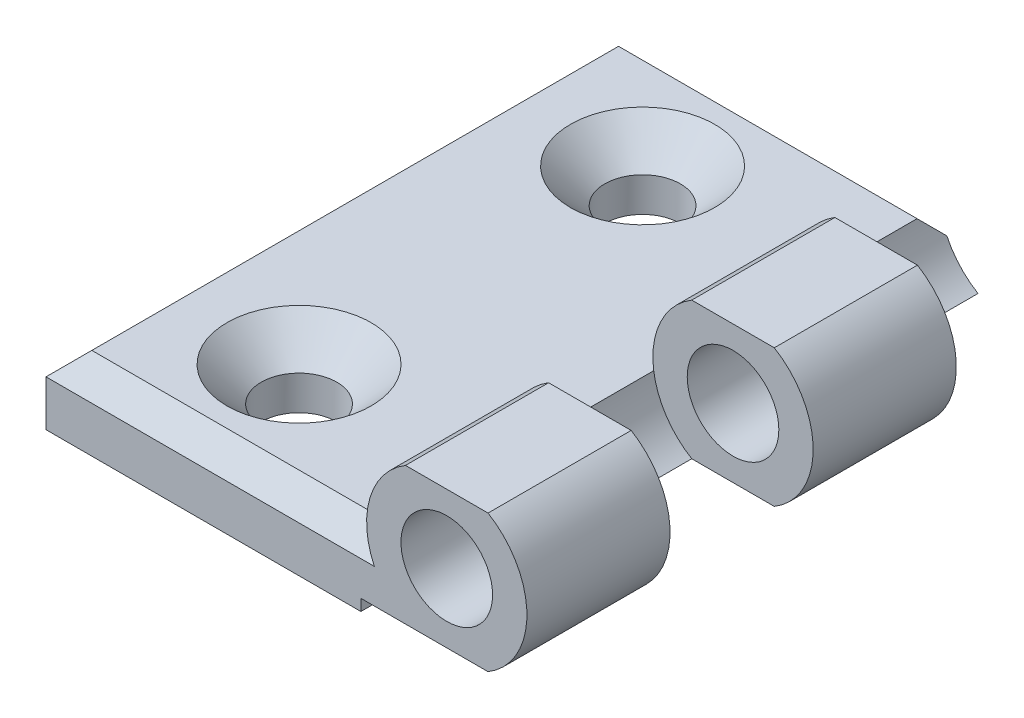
ISO-10303-21;
HEADER;
FILE_DESCRIPTION(('STEP AP214'),'2;1');
FILE_NAME('part.step','',(''),(''),'','','');
FILE_SCHEMA(('AUTOMOTIVE_DESIGN { 1 0 10303 214 1 1 1 1 }'));
ENDSEC;
DATA;
#1=APPLICATION_CONTEXT('core data for automotive mechanical design processes');
#2=APPLICATION_PROTOCOL_DEFINITION('international standard','automotive_design',2000,#1);
#3=PRODUCT_CONTEXT('',#1,'mechanical');
#4=PRODUCT('Part','Part','',(#3));
#5=PRODUCT_RELATED_PRODUCT_CATEGORY('part','',(#4));
#6=PRODUCT_DEFINITION_FORMATION('','',#4);
#7=PRODUCT_DEFINITION_CONTEXT('part definition',#1,'design');
#8=PRODUCT_DEFINITION('design','',#6,#7);
#9=PRODUCT_DEFINITION_SHAPE('','',#8);
#10=(LENGTH_UNIT() NAMED_UNIT(*) SI_UNIT(.MILLI.,.METRE.));
#11=(NAMED_UNIT(*) PLANE_ANGLE_UNIT() SI_UNIT($,.RADIAN.));
#12=(NAMED_UNIT(*) SI_UNIT($,.STERADIAN.) SOLID_ANGLE_UNIT());
#13=UNCERTAINTY_MEASURE_WITH_UNIT(LENGTH_MEASURE(1.E-05),#10,'distance_accuracy_value','');
#14=(GEOMETRIC_REPRESENTATION_CONTEXT(3) GLOBAL_UNCERTAINTY_ASSIGNED_CONTEXT((#13)) GLOBAL_UNIT_ASSIGNED_CONTEXT((#10,
#11,#12)) REPRESENTATION_CONTEXT('',''));
#15=CARTESIAN_POINT('',(0.,0.,0.));
#16=DIRECTION('',(0.,0.,1.));
#17=DIRECTION('',(1.,0.,0.));
#18=AXIS2_PLACEMENT_3D('',#15,#16,#17);
#19=CARTESIAN_POINT('',(0.,0.,25.));
#20=DIRECTION('',(0.,0.,-1.));
#21=DIRECTION('',(-1.,0.,0.));
#22=AXIS2_PLACEMENT_3D('',#19,#20,#21);
#23=CYLINDRICAL_SURFACE('',#22,7.);
#24=CARTESIAN_POINT('',(0.,0.,-12.5));
#25=DIRECTION('',(0.,0.,-1.));
#26=DIRECTION('',(-1.,0.,0.));
#27=AXIS2_PLACEMENT_3D('',#24,#25,#26);
#28=CIRCLE('',#27,7.);
#29=CARTESIAN_POINT('',(3.60555127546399,6.,-12.5));
#30=VERTEX_POINT('',#29);
#31=CARTESIAN_POINT('',(3.60555127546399,-6.,-12.5));
#32=VERTEX_POINT('',#31);
#33=EDGE_CURVE('E316',#30,#32,#28,.T.);
#34=ORIENTED_EDGE('',*,*,#33,.F.);
#35=DIRECTION('',(0.,0.,-1.));
#36=VECTOR('',#35,1.);
#37=CARTESIAN_POINT('',(3.60555127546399,6.,25.));
#38=LINE('',#37,#36);
#39=CARTESIAN_POINT('',(3.60555127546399,6.,0.));
#40=VERTEX_POINT('',#39);
#41=EDGE_CURVE('E221',#40,#30,#38,.T.);
#42=ORIENTED_EDGE('',*,*,#41,.F.);
#43=CARTESIAN_POINT('',(0.,0.,0.));
#44=DIRECTION('',(0.,0.,1.));
#45=DIRECTION('',(1.,0.,0.));
#46=AXIS2_PLACEMENT_3D('',#43,#44,#45);
#47=CIRCLE('',#46,7.);
#48=CARTESIAN_POINT('',(3.60555127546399,-6.,0.));
#49=VERTEX_POINT('',#48);
#50=EDGE_CURVE('E279',#49,#40,#47,.T.);
#51=ORIENTED_EDGE('',*,*,#50,.F.);
#52=DIRECTION('',(0.,0.,-1.));
#53=VECTOR('',#52,1.);
#54=CARTESIAN_POINT('',(3.60555127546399,-6.,25.));
#55=LINE('',#54,#53);
#56=EDGE_CURVE('E226',#49,#32,#55,.T.);
#57=ORIENTED_EDGE('',*,*,#56,.T.);
#58=EDGE_LOOP('',(#34,#42,#51,#57));
#59=FACE_BOUND('',#58,.T.);
#60=ADVANCED_FACE('F43',(#59),#23,.T.);
#61=CARTESIAN_POINT('',(3.60555127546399,6.,25.));
#62=DIRECTION('',(0.,-1.,0.));
#63=DIRECTION('',(0.,0.,-1.));
#64=AXIS2_PLACEMENT_3D('',#61,#62,#63);
#65=PLANE('',#64);
#66=DIRECTION('',(1.,0.,0.));
#67=VECTOR('',#66,1.);
#68=CARTESIAN_POINT('',(3.60555127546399,6.,-12.5));
#69=LINE('',#68,#67);
#70=CARTESIAN_POINT('',(-3.60555127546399,6.,-12.5));
#71=VERTEX_POINT('',#70);
#72=EDGE_CURVE('E305',#71,#30,#69,.T.);
#73=ORIENTED_EDGE('',*,*,#72,.F.);
#74=DIRECTION('',(0.,0.,-1.));
#75=VECTOR('',#74,1.);
#76=CARTESIAN_POINT('',(-3.60555127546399,6.,25.));
#77=LINE('',#76,#75);
#78=CARTESIAN_POINT('',(-3.60555127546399,6.,0.));
#79=VERTEX_POINT('',#78);
#80=EDGE_CURVE('E215',#79,#71,#77,.T.);
#81=ORIENTED_EDGE('',*,*,#80,.F.);
#82=DIRECTION('',(-1.,0.,0.));
#83=VECTOR('',#82,1.);
#84=CARTESIAN_POINT('',(3.60555127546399,6.,0.));
#85=LINE('',#84,#83);
#86=EDGE_CURVE('E425',#40,#79,#85,.T.);
#87=ORIENTED_EDGE('',*,*,#86,.F.);
#88=ORIENTED_EDGE('',*,*,#41,.T.);
#89=EDGE_LOOP('',(#73,#81,#87,#88));
#90=FACE_BOUND('',#89,.T.);
#91=ADVANCED_FACE('F478',(#90),#65,.F.);
#92=CARTESIAN_POINT('',(0.,0.,25.));
#93=DIRECTION('',(0.,0.,-1.));
#94=DIRECTION('',(-1.,0.,0.));
#95=AXIS2_PLACEMENT_3D('',#92,#93,#94);
#96=CYLINDRICAL_SURFACE('',#95,7.);
#97=CARTESIAN_POINT('',(-6.92820323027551,-1.,-12.5));
#98=VERTEX_POINT('',#97);
#99=EDGE_CURVE('E185',#98,#71,#28,.T.);
#100=ORIENTED_EDGE('',*,*,#99,.F.);
#101=DIRECTION('',(0.,0.,-1.));
#102=VECTOR('',#101,1.);
#103=CARTESIAN_POINT('',(-6.92820323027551,-1.,25.));
#104=LINE('',#103,#102);
#105=CARTESIAN_POINT('',(-6.92820323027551,-1.,0.));
#106=VERTEX_POINT('',#105);
#107=EDGE_CURVE('E209',#106,#98,#104,.T.);
#108=ORIENTED_EDGE('',*,*,#107,.F.);
#109=EDGE_CURVE('E61',#79,#106,#47,.T.);
#110=ORIENTED_EDGE('',*,*,#109,.F.);
#111=ORIENTED_EDGE('',*,*,#80,.T.);
#112=EDGE_LOOP('',(#100,#108,#110,#111));
#113=FACE_BOUND('',#112,.T.);
#114=ADVANCED_FACE('F485',(#113),#96,.T.);
#115=CARTESIAN_POINT('',(0.,0.,25.));
#116=DIRECTION('',(0.,0.,-1.));
#117=DIRECTION('',(-1.,0.,0.));
#118=AXIS2_PLACEMENT_3D('',#115,#116,#117);
#119=CYLINDRICAL_SURFACE('',#118,4.);
#120=CARTESIAN_POINT('',(0.,0.,0.));
#121=DIRECTION('',(0.,0.,1.));
#122=DIRECTION('',(1.,0.,0.));
#123=AXIS2_PLACEMENT_3D('',#120,#121,#122);
#124=CIRCLE('',#123,4.);
#125=CARTESIAN_POINT('',(4.,0.,0.));
#126=VERTEX_POINT('',#125);
#127=EDGE_CURVE('E47',#126,#126,#124,.T.);
#128=ORIENTED_EDGE('',*,*,#127,.T.);
#129=EDGE_LOOP('',(#128));
#130=FACE_BOUND('',#129,.T.);
#131=CARTESIAN_POINT('',(0.,0.,-12.5));
#132=DIRECTION('',(0.,0.,-1.));
#133=DIRECTION('',(-1.,0.,0.));
#134=AXIS2_PLACEMENT_3D('',#131,#132,#133);
#135=CIRCLE('',#134,4.);
#136=CARTESIAN_POINT('',(-4.,0.,-12.5));
#137=VERTEX_POINT('',#136);
#138=EDGE_CURVE('E173',#137,#137,#135,.T.);
#139=ORIENTED_EDGE('',*,*,#138,.T.);
#140=EDGE_LOOP('',(#139));
#141=FACE_BOUND('',#140,.T.);
#142=ADVANCED_FACE('F437',(#130,#141),#119,.F.);
#143=CARTESIAN_POINT('',(-7.5,-6.,25.));
#144=DIRECTION('',(0.,1.,0.));
#145=DIRECTION('',(0.,0.,1.));
#146=AXIS2_PLACEMENT_3D('',#143,#144,#145);
#147=PLANE('',#146);
#148=DIRECTION('',(1.,0.,0.));
#149=VECTOR('',#148,1.);
#150=CARTESIAN_POINT('',(-7.5,-6.,-25.));
#151=LINE('',#150,#149);
#152=CARTESIAN_POINT('',(-7.5,-6.,-25.));
#153=VERTEX_POINT('',#152);
#154=CARTESIAN_POINT('',(-3.60555127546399,-6.,-25.));
#155=VERTEX_POINT('',#154);
#156=EDGE_CURVE('E179',#153,#155,#151,.T.);
#157=ORIENTED_EDGE('',*,*,#156,.T.);
#158=DIRECTION('',(0.,0.,-1.));
#159=VECTOR('',#158,1.);
#160=CARTESIAN_POINT('',(-3.60555127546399,-6.,-12.5));
#161=LINE('',#160,#159);
#162=CARTESIAN_POINT('',(-3.60555127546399,-6.,-12.5));
#163=VERTEX_POINT('',#162);
#164=EDGE_CURVE('E162',#155,#163,#161,.F.);
#165=ORIENTED_EDGE('',*,*,#164,.T.);
#166=DIRECTION('',(-1.,0.,0.));
#167=VECTOR('',#166,1.);
#168=CARTESIAN_POINT('',(-7.5,-6.,-12.5));
#169=LINE('',#168,#167);
#170=EDGE_CURVE('E300',#32,#163,#169,.T.);
#171=ORIENTED_EDGE('',*,*,#170,.F.);
#172=ORIENTED_EDGE('',*,*,#56,.F.);
#173=DIRECTION('',(1.,0.,0.));
#174=VECTOR('',#173,1.);
#175=CARTESIAN_POINT('',(-7.5,-6.,0.));
#176=LINE('',#175,#174);
#177=CARTESIAN_POINT('',(-3.60555127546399,-6.,0.));
#178=VERTEX_POINT('',#177);
#179=EDGE_CURVE('E422',#178,#49,#176,.T.);
#180=ORIENTED_EDGE('',*,*,#179,.F.);
#181=DIRECTION('',(0.,0.,1.));
#182=VECTOR('',#181,1.);
#183=CARTESIAN_POINT('',(-3.60555127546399,-6.,0.));
#184=LINE('',#183,#182);
#185=CARTESIAN_POINT('',(-3.60555127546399,-6.,12.5));
#186=VERTEX_POINT('',#185);
#187=EDGE_CURVE('E261',#178,#186,#184,.T.);
#188=ORIENTED_EDGE('',*,*,#187,.T.);
#189=DIRECTION('',(1.,0.,0.));
#190=VECTOR('',#189,1.);
#191=CARTESIAN_POINT('',(-7.5,-6.,12.5));
#192=LINE('',#191,#190);
#193=CARTESIAN_POINT('',(3.60555127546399,-6.,12.5));
#194=VERTEX_POINT('',#193);
#195=EDGE_CURVE('E275',#186,#194,#192,.T.);
#196=ORIENTED_EDGE('',*,*,#195,.T.);
#197=CARTESIAN_POINT('',(3.60555127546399,-6.,25.));
#198=VERTEX_POINT('',#197);
#199=EDGE_CURVE('E227',#198,#194,#55,.T.);
#200=ORIENTED_EDGE('',*,*,#199,.F.);
#201=DIRECTION('',(1.,0.,0.));
#202=VECTOR('',#201,1.);
#203=CARTESIAN_POINT('',(-7.5,-6.,25.));
#204=LINE('',#203,#202);
#205=CARTESIAN_POINT('',(-7.5,-6.,25.));
#206=VERTEX_POINT('',#205);
#207=EDGE_CURVE('E365',#206,#198,#204,.T.);
#208=ORIENTED_EDGE('',*,*,#207,.F.);
#209=DIRECTION('',(0.,0.,-1.));
#210=VECTOR('',#209,1.);
#211=CARTESIAN_POINT('',(-7.5,-6.,25.));
#212=LINE('',#211,#210);
#213=EDGE_CURVE('E191',#206,#153,#212,.T.);
#214=ORIENTED_EDGE('',*,*,#213,.T.);
#215=EDGE_LOOP('',(#157,#165,#171,#172,#180,#188,#196,#200,#208,#214));
#216=FACE_BOUND('',#215,.T.);
#217=ADVANCED_FACE('F188',(#216),#147,.F.);
#218=CARTESIAN_POINT('',(0.,0.,25.));
#219=DIRECTION('',(0.,0.,1.));
#220=DIRECTION('',(1.,0.,0.));
#221=AXIS2_PLACEMENT_3D('',#218,#219,#220);
#222=PLANE('',#221);
#223=CARTESIAN_POINT('',(0.,0.,25.));
#224=DIRECTION('',(0.,0.,1.));
#225=DIRECTION('',(1.,0.,0.));
#226=AXIS2_PLACEMENT_3D('',#223,#224,#225);
#227=CIRCLE('',#226,7.);
#228=CARTESIAN_POINT('',(-3.60555127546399,6.,25.));
#229=VERTEX_POINT('',#228);
#230=CARTESIAN_POINT('',(-6.32455532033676,-3.00000000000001,25.));
#231=VERTEX_POINT('',#230);
#232=EDGE_CURVE('E69',#229,#231,#227,.T.);
#233=ORIENTED_EDGE('',*,*,#232,.T.);
#234=DIRECTION('',(-1.,0.,0.));
#235=VECTOR('',#234,1.);
#236=CARTESIAN_POINT('',(-35.,-3.00000000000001,25.));
#237=LINE('',#236,#235);
#238=CARTESIAN_POINT('',(-35.,-3.00000000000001,25.));
#239=VERTEX_POINT('',#238);
#240=EDGE_CURVE('E252',#231,#239,#237,.T.);
#241=ORIENTED_EDGE('',*,*,#240,.T.);
#242=DIRECTION('',(0.,-1.,0.));
#243=VECTOR('',#242,1.);
#244=CARTESIAN_POINT('',(-35.,-7.,25.));
#245=LINE('',#244,#243);
#246=CARTESIAN_POINT('',(-35.,-7.,25.));
#247=VERTEX_POINT('',#246);
#248=EDGE_CURVE('E210',#239,#247,#245,.T.);
#249=ORIENTED_EDGE('',*,*,#248,.T.);
#250=DIRECTION('',(1.,0.,0.));
#251=VECTOR('',#250,1.);
#252=CARTESIAN_POINT('',(-7.5,-7.,25.));
#253=LINE('',#252,#251);
#254=CARTESIAN_POINT('',(-7.5,-7.,25.));
#255=VERTEX_POINT('',#254);
#256=EDGE_CURVE('E199',#247,#255,#253,.T.);
#257=ORIENTED_EDGE('',*,*,#256,.T.);
#258=DIRECTION('',(0.,1.,0.));
#259=VECTOR('',#258,1.);
#260=CARTESIAN_POINT('',(-7.5,-7.,25.));
#261=LINE('',#260,#259);
#262=EDGE_CURVE('E369',#255,#206,#261,.T.);
#263=ORIENTED_EDGE('',*,*,#262,.T.);
#264=ORIENTED_EDGE('',*,*,#207,.T.);
#265=CARTESIAN_POINT('',(0.,0.,25.));
#266=DIRECTION('',(0.,0.,1.));
#267=DIRECTION('',(1.,0.,0.));
#268=AXIS2_PLACEMENT_3D('',#265,#266,#267);
#269=CIRCLE('',#268,7.);
#270=CARTESIAN_POINT('',(3.60555127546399,6.,25.));
#271=VERTEX_POINT('',#270);
#272=EDGE_CURVE('E361',#198,#271,#269,.T.);
#273=ORIENTED_EDGE('',*,*,#272,.T.);
#274=DIRECTION('',(-1.,0.,0.));
#275=VECTOR('',#274,1.);
#276=CARTESIAN_POINT('',(3.60555127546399,6.,25.));
#277=LINE('',#276,#275);
#278=EDGE_CURVE('E357',#271,#229,#277,.T.);
#279=ORIENTED_EDGE('',*,*,#278,.T.);
#280=EDGE_LOOP('',(#233,#241,#249,#257,#263,#264,#273,#279));
#281=FACE_BOUND('',#280,.T.);
#282=CARTESIAN_POINT('',(0.,0.,25.));
#283=DIRECTION('',(0.,0.,1.));
#284=DIRECTION('',(1.,0.,0.));
#285=AXIS2_PLACEMENT_3D('',#282,#283,#284);
#286=CIRCLE('',#285,4.);
#287=CARTESIAN_POINT('',(4.,0.,25.));
#288=VERTEX_POINT('',#287);
#289=EDGE_CURVE('E381',#288,#288,#286,.T.);
#290=ORIENTED_EDGE('',*,*,#289,.F.);
#291=EDGE_LOOP('',(#290));
#292=FACE_BOUND('',#291,.T.);
#293=ADVANCED_FACE('F461',(#281,#292),#222,.T.);
#294=CARTESIAN_POINT('',(0.,0.,-25.));
#295=DIRECTION('',(0.,0.,1.));
#296=DIRECTION('',(1.,0.,0.));
#297=AXIS2_PLACEMENT_3D('',#294,#295,#296);
#298=PLANE('',#297);
#299=DIRECTION('',(1.,0.,0.));
#300=VECTOR('',#299,1.);
#301=CARTESIAN_POINT('',(0.,-3.00000000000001,-25.));
#302=LINE('',#301,#300);
#303=CARTESIAN_POINT('',(-35.,-3.00000000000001,-25.));
#304=VERTEX_POINT('',#303);
#305=CARTESIAN_POINT('',(-6.32455532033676,-3.00000000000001,-25.));
#306=VERTEX_POINT('',#305);
#307=EDGE_CURVE('E182',#304,#306,#302,.T.);
#308=ORIENTED_EDGE('',*,*,#307,.T.);
#309=CARTESIAN_POINT('',(0.,0.,-25.));
#310=DIRECTION('',(0.,0.,-1.));
#311=DIRECTION('',(-1.,0.,0.));
#312=AXIS2_PLACEMENT_3D('',#309,#310,#311);
#313=CIRCLE('',#312,7.);
#314=EDGE_CURVE('E165',#155,#306,#313,.T.);
#315=ORIENTED_EDGE('',*,*,#314,.F.);
#316=ORIENTED_EDGE('',*,*,#156,.F.);
#317=DIRECTION('',(0.,1.,0.));
#318=VECTOR('',#317,1.);
#319=CARTESIAN_POINT('',(-7.5,-7.,-25.));
#320=LINE('',#319,#318);
#321=CARTESIAN_POINT('',(-7.5,-7.,-25.));
#322=VERTEX_POINT('',#321);
#323=EDGE_CURVE('E194',#322,#153,#320,.T.);
#324=ORIENTED_EDGE('',*,*,#323,.F.);
#325=DIRECTION('',(1.,0.,0.));
#326=VECTOR('',#325,1.);
#327=CARTESIAN_POINT('',(-7.5,-7.,-25.));
#328=LINE('',#327,#326);
#329=CARTESIAN_POINT('',(-35.,-7.,-25.));
#330=VERTEX_POINT('',#329);
#331=EDGE_CURVE('E201',#330,#322,#328,.T.);
#332=ORIENTED_EDGE('',*,*,#331,.F.);
#333=DIRECTION('',(0.,-1.,0.));
#334=VECTOR('',#333,1.);
#335=CARTESIAN_POINT('',(-35.,-7.,-25.));
#336=LINE('',#335,#334);
#337=EDGE_CURVE('E193',#304,#330,#336,.T.);
#338=ORIENTED_EDGE('',*,*,#337,.F.);
#339=EDGE_LOOP('',(#308,#315,#316,#324,#332,#338));
#340=FACE_BOUND('',#339,.T.);
#341=ADVANCED_FACE('F178',(#340),#298,.F.);
#342=CARTESIAN_POINT('',(-7.5,-7.,25.));
#343=DIRECTION('',(0.,1.,0.));
#344=DIRECTION('',(-1.,0.,0.));
#345=AXIS2_PLACEMENT_3D('',#342,#343,#344);
#346=PLANE('',#345);
#347=CARTESIAN_POINT('',(-22.9,-7.,15.));
#348=DIRECTION('',(0.,1.,0.));
#349=DIRECTION('',(-1.,0.,0.));
#350=AXIS2_PLACEMENT_3D('',#347,#348,#349);
#351=CIRCLE('',#350,3.3);
#352=CARTESIAN_POINT('',(-26.2,-7.,15.));
#353=VERTEX_POINT('',#352);
#354=EDGE_CURVE('E408',#353,#353,#351,.T.);
#355=ORIENTED_EDGE('',*,*,#354,.T.);
#356=EDGE_LOOP('',(#355));
#357=FACE_BOUND('',#356,.T.);
#358=CARTESIAN_POINT('',(-22.9,-7.,-15.));
#359=DIRECTION('',(0.,1.,0.));
#360=DIRECTION('',(-1.,0.,0.));
#361=AXIS2_PLACEMENT_3D('',#358,#359,#360);
#362=CIRCLE('',#361,3.3);
#363=CARTESIAN_POINT('',(-26.2,-7.,-15.));
#364=VERTEX_POINT('',#363);
#365=EDGE_CURVE('E390',#364,#364,#362,.T.);
#366=ORIENTED_EDGE('',*,*,#365,.T.);
#367=EDGE_LOOP('',(#366));
#368=FACE_BOUND('',#367,.T.);
#369=ORIENTED_EDGE('',*,*,#331,.T.);
#370=DIRECTION('',(0.,0.,-1.));
#371=VECTOR('',#370,1.);
#372=CARTESIAN_POINT('',(-7.5,-7.,25.));
#373=LINE('',#372,#371);
#374=EDGE_CURVE('E233',#255,#322,#373,.T.);
#375=ORIENTED_EDGE('',*,*,#374,.F.);
#376=ORIENTED_EDGE('',*,*,#256,.F.);
#377=DIRECTION('',(0.,0.,-1.));
#378=VECTOR('',#377,1.);
#379=CARTESIAN_POINT('',(-35.,-7.,25.));
#380=LINE('',#379,#378);
#381=EDGE_CURVE('E205',#247,#330,#380,.T.);
#382=ORIENTED_EDGE('',*,*,#381,.T.);
#383=EDGE_LOOP('',(#369,#375,#376,#382));
#384=FACE_BOUND('',#383,.T.);
#385=ADVANCED_FACE('F466',(#357,#368,#384),#346,.F.);
#386=CARTESIAN_POINT('',(-7.5,-7.,25.));
#387=DIRECTION('',(-1.,0.,0.));
#388=DIRECTION('',(0.,0.,1.));
#389=AXIS2_PLACEMENT_3D('',#386,#387,#388);
#390=PLANE('',#389);
#391=ORIENTED_EDGE('',*,*,#323,.T.);
#392=ORIENTED_EDGE('',*,*,#213,.F.);
#393=ORIENTED_EDGE('',*,*,#262,.F.);
#394=ORIENTED_EDGE('',*,*,#374,.T.);
#395=EDGE_LOOP('',(#391,#392,#393,#394));
#396=FACE_BOUND('',#395,.T.);
#397=ADVANCED_FACE('F468',(#396),#390,.F.);
#398=ORIENTED_EDGE('',*,*,#199,.T.);
#399=CARTESIAN_POINT('',(0.,0.,12.5));
#400=DIRECTION('',(0.,0.,1.));
#401=DIRECTION('',(1.,0.,0.));
#402=AXIS2_PLACEMENT_3D('',#399,#400,#401);
#403=CIRCLE('',#402,7.);
#404=CARTESIAN_POINT('',(3.60555127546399,6.,12.5));
#405=VERTEX_POINT('',#404);
#406=EDGE_CURVE('E292',#194,#405,#403,.T.);
#407=ORIENTED_EDGE('',*,*,#406,.T.);
#408=EDGE_CURVE('E222',#271,#405,#38,.T.);
#409=ORIENTED_EDGE('',*,*,#408,.F.);
#410=ORIENTED_EDGE('',*,*,#272,.F.);
#411=EDGE_LOOP('',(#398,#407,#409,#410));
#412=FACE_BOUND('',#411,.T.);
#413=ADVANCED_FACE('F470',(#412),#23,.T.);
#414=ORIENTED_EDGE('',*,*,#408,.T.);
#415=DIRECTION('',(-1.,0.,0.));
#416=VECTOR('',#415,1.);
#417=CARTESIAN_POINT('',(3.60555127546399,6.,12.5));
#418=LINE('',#417,#416);
#419=CARTESIAN_POINT('',(-3.60555127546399,6.,12.5));
#420=VERTEX_POINT('',#419);
#421=EDGE_CURVE('E268',#405,#420,#418,.T.);
#422=ORIENTED_EDGE('',*,*,#421,.T.);
#423=EDGE_CURVE('E217',#229,#420,#77,.T.);
#424=ORIENTED_EDGE('',*,*,#423,.F.);
#425=ORIENTED_EDGE('',*,*,#278,.F.);
#426=EDGE_LOOP('',(#414,#422,#424,#425));
#427=FACE_BOUND('',#426,.T.);
#428=ADVANCED_FACE('F451',(#427),#65,.F.);
#429=ORIENTED_EDGE('',*,*,#423,.T.);
#430=CARTESIAN_POINT('',(-6.92820323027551,-1.,12.5));
#431=VERTEX_POINT('',#430);
#432=EDGE_CURVE('E285',#420,#431,#403,.T.);
#433=ORIENTED_EDGE('',*,*,#432,.T.);
#434=CARTESIAN_POINT('',(-6.92820323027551,-1.,23.));
#435=VERTEX_POINT('',#434);
#436=EDGE_CURVE('E211',#435,#431,#104,.T.);
#437=ORIENTED_EDGE('',*,*,#436,.F.);
#438=CARTESIAN_POINT('',(0.,0.,22.));
#439=DIRECTION('',(0.,0.707106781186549,0.707106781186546));
#440=DIRECTION('',(0.,0.707106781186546,-0.707106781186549));
#441=AXIS2_PLACEMENT_3D('',#438,#439,#440);
#442=ELLIPSE('',#441,9.89949493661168,7.);
#443=EDGE_CURVE('E11',#435,#231,#442,.T.);
#444=ORIENTED_EDGE('',*,*,#443,.T.);
#445=ORIENTED_EDGE('',*,*,#232,.F.);
#446=EDGE_LOOP('',(#429,#433,#437,#444,#445));
#447=FACE_BOUND('',#446,.T.);
#448=ADVANCED_FACE('F453',(#447),#96,.T.);
#449=CARTESIAN_POINT('',(-6.92820323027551,-1.,25.));
#450=DIRECTION('',(0.,-1.,0.));
#451=DIRECTION('',(1.,0.,0.));
#452=AXIS2_PLACEMENT_3D('',#449,#450,#451);
#453=PLANE('',#452);
#454=CARTESIAN_POINT('',(-22.9,-1.,15.));
#455=DIRECTION('',(0.,1.,0.));
#456=DIRECTION('',(0.,0.,1.));
#457=AXIS2_PLACEMENT_3D('',#454,#455,#456);
#458=CIRCLE('',#457,6.3);
#459=CARTESIAN_POINT('',(-22.9,-1.,21.3));
#460=VERTEX_POINT('',#459);
#461=EDGE_CURVE('E264',#460,#460,#458,.T.);
#462=ORIENTED_EDGE('',*,*,#461,.F.);
#463=EDGE_LOOP('',(#462));
#464=FACE_BOUND('',#463,.T.);
#465=CARTESIAN_POINT('',(-22.9,-1.,-15.));
#466=DIRECTION('',(0.,1.,0.));
#467=DIRECTION('',(0.,0.,1.));
#468=AXIS2_PLACEMENT_3D('',#465,#466,#467);
#469=CIRCLE('',#468,6.3);
#470=CARTESIAN_POINT('',(-22.9,-1.,-8.7));
#471=VERTEX_POINT('',#470);
#472=EDGE_CURVE('E402',#471,#471,#469,.T.);
#473=ORIENTED_EDGE('',*,*,#472,.F.);
#474=EDGE_LOOP('',(#473));
#475=FACE_BOUND('',#474,.T.);
#476=ORIENTED_EDGE('',*,*,#436,.T.);
#477=EDGE_CURVE('E216',#431,#106,#104,.T.);
#478=ORIENTED_EDGE('',*,*,#477,.T.);
#479=ORIENTED_EDGE('',*,*,#107,.T.);
#480=DIRECTION('',(0.,0.,-1.));
#481=VECTOR('',#480,1.);
#482=CARTESIAN_POINT('',(-6.92820323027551,-1.,-12.5));
#483=LINE('',#482,#481);
#484=CARTESIAN_POINT('',(-6.92820323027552,-0.999999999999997,-23.));
#485=VERTEX_POINT('',#484);
#486=EDGE_CURVE('E174',#98,#485,#483,.T.);
#487=ORIENTED_EDGE('',*,*,#486,.T.);
#488=DIRECTION('',(-1.,0.,0.));
#489=VECTOR('',#488,1.);
#490=CARTESIAN_POINT('',(-6.92820323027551,-1.,-23.));
#491=LINE('',#490,#489);
#492=CARTESIAN_POINT('',(-33.,-1.,-23.));
#493=VERTEX_POINT('',#492);
#494=EDGE_CURVE('E243',#485,#493,#491,.T.);
#495=ORIENTED_EDGE('',*,*,#494,.T.);
#496=DIRECTION('',(0.,0.,1.));
#497=VECTOR('',#496,1.);
#498=CARTESIAN_POINT('',(-33.,-1.,25.));
#499=LINE('',#498,#497);
#500=CARTESIAN_POINT('',(-33.,-1.,23.));
#501=VERTEX_POINT('',#500);
#502=EDGE_CURVE('E240',#493,#501,#499,.T.);
#503=ORIENTED_EDGE('',*,*,#502,.T.);
#504=DIRECTION('',(1.,0.,0.));
#505=VECTOR('',#504,1.);
#506=CARTESIAN_POINT('',(-6.92820323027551,-1.,23.));
#507=LINE('',#506,#505);
#508=EDGE_CURVE('E237',#501,#435,#507,.T.);
#509=ORIENTED_EDGE('',*,*,#508,.T.);
#510=EDGE_LOOP('',(#476,#478,#479,#487,#495,#503,#509));
#511=FACE_BOUND('',#510,.T.);
#512=ADVANCED_FACE('F494',(#464,#475,#511),#453,.F.);
#513=CARTESIAN_POINT('',(-35.,-7.,25.));
#514=DIRECTION('',(1.,0.,0.));
#515=DIRECTION('',(0.,0.,-1.));
#516=AXIS2_PLACEMENT_3D('',#513,#514,#515);
#517=PLANE('',#516);
#518=ORIENTED_EDGE('',*,*,#248,.F.);
#519=DIRECTION('',(0.,0.,-1.));
#520=VECTOR('',#519,1.);
#521=CARTESIAN_POINT('',(-35.,-3.00000000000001,25.));
#522=LINE('',#521,#520);
#523=EDGE_CURVE('E249',#239,#304,#522,.T.);
#524=ORIENTED_EDGE('',*,*,#523,.T.);
#525=ORIENTED_EDGE('',*,*,#337,.T.);
#526=ORIENTED_EDGE('',*,*,#381,.F.);
#527=EDGE_LOOP('',(#518,#524,#525,#526));
#528=FACE_BOUND('',#527,.T.);
#529=ADVANCED_FACE('F465',(#528),#517,.F.);
#530=CARTESIAN_POINT('',(0.,0.,12.5));
#531=DIRECTION('',(0.,0.,1.));
#532=DIRECTION('',(1.,0.,0.));
#533=AXIS2_PLACEMENT_3D('',#530,#531,#532);
#534=CIRCLE('',#533,4.);
#535=CARTESIAN_POINT('',(4.,0.,12.5));
#536=VERTEX_POINT('',#535);
#537=EDGE_CURVE('E265',#536,#536,#534,.T.);
#538=ORIENTED_EDGE('',*,*,#537,.F.);
#539=EDGE_LOOP('',(#538));
#540=FACE_BOUND('',#539,.T.);
#541=ORIENTED_EDGE('',*,*,#289,.T.);
#542=EDGE_LOOP('',(#541));
#543=FACE_BOUND('',#542,.T.);
#544=ADVANCED_FACE('F500',(#540,#543),#119,.F.);
#545=CARTESIAN_POINT('',(-22.9,-1.,-15.));
#546=DIRECTION('',(0.,1.,0.));
#547=DIRECTION('',(0.,0.,1.));
#548=AXIS2_PLACEMENT_3D('',#545,#546,#547);
#549=CYLINDRICAL_SURFACE('',#548,3.3);
#550=ORIENTED_EDGE('',*,*,#365,.F.);
#551=EDGE_LOOP('',(#550));
#552=FACE_BOUND('',#551,.T.);
#553=CARTESIAN_POINT('',(-22.9,-4.,-15.));
#554=DIRECTION('',(0.,1.,0.));
#555=DIRECTION('',(0.,0.,1.));
#556=AXIS2_PLACEMENT_3D('',#553,#554,#555);
#557=CIRCLE('',#556,3.3);
#558=CARTESIAN_POINT('',(-22.9,-4.,-11.7));
#559=VERTEX_POINT('',#558);
#560=EDGE_CURVE('E396',#559,#559,#557,.T.);
#561=ORIENTED_EDGE('',*,*,#560,.T.);
#562=EDGE_LOOP('',(#561));
#563=FACE_BOUND('',#562,.T.);
#564=ADVANCED_FACE('F507',(#552,#563),#549,.F.);
#565=CARTESIAN_POINT('',(-22.9,-1.,-15.));
#566=DIRECTION('',(0.,1.,0.));
#567=DIRECTION('',(0.,0.,1.));
#568=AXIS2_PLACEMENT_3D('',#565,#566,#567);
#569=CONICAL_SURFACE('',#568,6.3,0.785398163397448);
#570=ORIENTED_EDGE('',*,*,#560,.F.);
#571=EDGE_LOOP('',(#570));
#572=FACE_BOUND('',#571,.T.);
#573=ORIENTED_EDGE('',*,*,#472,.T.);
#574=EDGE_LOOP('',(#573));
#575=FACE_BOUND('',#574,.T.);
#576=ADVANCED_FACE('F511',(#572,#575),#569,.F.);
#577=CARTESIAN_POINT('',(-22.9,-1.,15.));
#578=DIRECTION('',(0.,1.,0.));
#579=DIRECTION('',(0.,0.,1.));
#580=AXIS2_PLACEMENT_3D('',#577,#578,#579);
#581=CYLINDRICAL_SURFACE('',#580,3.3);
#582=ORIENTED_EDGE('',*,*,#354,.F.);
#583=EDGE_LOOP('',(#582));
#584=FACE_BOUND('',#583,.T.);
#585=CARTESIAN_POINT('',(-22.9,-4.,15.));
#586=DIRECTION('',(0.,1.,0.));
#587=DIRECTION('',(0.,0.,1.));
#588=AXIS2_PLACEMENT_3D('',#585,#586,#587);
#589=CIRCLE('',#588,3.3);
#590=CARTESIAN_POINT('',(-22.9,-4.,18.3));
#591=VERTEX_POINT('',#590);
#592=EDGE_CURVE('E412',#591,#591,#589,.T.);
#593=ORIENTED_EDGE('',*,*,#592,.T.);
#594=EDGE_LOOP('',(#593));
#595=FACE_BOUND('',#594,.T.);
#596=ADVANCED_FACE('F515',(#584,#595),#581,.F.);
#597=CARTESIAN_POINT('',(-22.9,-1.,15.));
#598=DIRECTION('',(0.,1.,0.));
#599=DIRECTION('',(0.,0.,1.));
#600=AXIS2_PLACEMENT_3D('',#597,#598,#599);
#601=CONICAL_SURFACE('',#600,6.3,0.785398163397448);
#602=ORIENTED_EDGE('',*,*,#592,.F.);
#603=EDGE_LOOP('',(#602));
#604=FACE_BOUND('',#603,.T.);
#605=ORIENTED_EDGE('',*,*,#461,.T.);
#606=EDGE_LOOP('',(#605));
#607=FACE_BOUND('',#606,.T.);
#608=ADVANCED_FACE('F519',(#604,#607),#601,.F.);
#609=CARTESIAN_POINT('',(0.,-3.00000000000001,25.));
#610=DIRECTION('',(0.,0.707106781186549,0.707106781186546));
#611=DIRECTION('',(1.,0.,0.));
#612=AXIS2_PLACEMENT_3D('',#609,#610,#611);
#613=PLANE('',#612);
#614=ORIENTED_EDGE('',*,*,#443,.F.);
#615=ORIENTED_EDGE('',*,*,#508,.F.);
#616=DIRECTION('',(0.577350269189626,0.577350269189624,-0.577350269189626));
#617=VECTOR('',#616,1.);
#618=CARTESIAN_POINT('',(-23.3333333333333,8.66666666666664,13.3333333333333));
#619=LINE('',#618,#617);
#620=EDGE_CURVE('E260',#239,#501,#619,.T.);
#621=ORIENTED_EDGE('',*,*,#620,.F.);
#622=ORIENTED_EDGE('',*,*,#240,.F.);
#623=EDGE_LOOP('',(#614,#615,#621,#622));
#624=FACE_BOUND('',#623,.T.);
#625=ADVANCED_FACE('F45',(#624),#613,.T.);
#626=CARTESIAN_POINT('',(-35.,-3.00000000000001,25.));
#627=DIRECTION('',(0.707106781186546,-0.707106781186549,0.));
#628=DIRECTION('',(0.,0.,-1.));
#629=AXIS2_PLACEMENT_3D('',#626,#627,#628);
#630=PLANE('',#629);
#631=ORIENTED_EDGE('',*,*,#620,.T.);
#632=ORIENTED_EDGE('',*,*,#502,.F.);
#633=DIRECTION('',(-0.577350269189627,-0.577350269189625,-0.577350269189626));
#634=VECTOR('',#633,1.);
#635=CARTESIAN_POINT('',(-18.3333333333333,13.6666666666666,-8.3333333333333));
#636=LINE('',#635,#634);
#637=EDGE_CURVE('E257',#304,#493,#636,.F.);
#638=ORIENTED_EDGE('',*,*,#637,.F.);
#639=ORIENTED_EDGE('',*,*,#523,.F.);
#640=EDGE_LOOP('',(#631,#632,#638,#639));
#641=FACE_BOUND('',#640,.T.);
#642=ADVANCED_FACE('F547',(#641),#630,.F.);
#643=CARTESIAN_POINT('',(-6.92820323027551,-1.,-23.));
#644=DIRECTION('',(0.,-0.707106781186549,0.707106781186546));
#645=DIRECTION('',(-1.,0.,0.));
#646=AXIS2_PLACEMENT_3D('',#643,#644,#645);
#647=PLANE('',#646);
#648=CARTESIAN_POINT('',(0.,0.,-22.));
#649=DIRECTION('',(0.,-0.707106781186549,0.707106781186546));
#650=DIRECTION('',(0.,-0.707106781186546,-0.707106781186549));
#651=AXIS2_PLACEMENT_3D('',#648,#649,#650);
#652=ELLIPSE('',#651,9.89949493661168,7.);
#653=EDGE_CURVE('E53',#306,#485,#652,.F.);
#654=ORIENTED_EDGE('',*,*,#653,.F.);
#655=ORIENTED_EDGE('',*,*,#307,.F.);
#656=ORIENTED_EDGE('',*,*,#637,.T.);
#657=ORIENTED_EDGE('',*,*,#494,.F.);
#658=EDGE_LOOP('',(#654,#655,#656,#657));
#659=FACE_BOUND('',#658,.T.);
#660=ADVANCED_FACE('F526',(#659),#647,.F.);
#661=CARTESIAN_POINT('',(0.,0.,0.));
#662=DIRECTION('',(0.,0.,1.));
#663=DIRECTION('',(1.,0.,0.));
#664=AXIS2_PLACEMENT_3D('',#661,#662,#663);
#665=CYLINDRICAL_SURFACE('',#664,7.);
#666=EDGE_CURVE('E277',#106,#178,#47,.T.);
#667=ORIENTED_EDGE('',*,*,#666,.F.);
#668=ORIENTED_EDGE('',*,*,#477,.F.);
#669=EDGE_CURVE('E291',#431,#186,#403,.T.);
#670=ORIENTED_EDGE('',*,*,#669,.T.);
#671=ORIENTED_EDGE('',*,*,#187,.F.);
#672=EDGE_LOOP('',(#667,#668,#670,#671));
#673=FACE_BOUND('',#672,.T.);
#674=ADVANCED_FACE('F443',(#673),#665,.F.);
#675=CARTESIAN_POINT('',(0.,0.,0.));
#676=DIRECTION('',(0.,0.,1.));
#677=DIRECTION('',(1.,0.,0.));
#678=AXIS2_PLACEMENT_3D('',#675,#676,#677);
#679=PLANE('',#678);
#680=ORIENTED_EDGE('',*,*,#127,.F.);
#681=EDGE_LOOP('',(#680));
#682=FACE_BOUND('',#681,.T.);
#683=ORIENTED_EDGE('',*,*,#179,.T.);
#684=ORIENTED_EDGE('',*,*,#50,.T.);
#685=ORIENTED_EDGE('',*,*,#86,.T.);
#686=ORIENTED_EDGE('',*,*,#109,.T.);
#687=ORIENTED_EDGE('',*,*,#666,.T.);
#688=EDGE_LOOP('',(#683,#684,#685,#686,#687));
#689=FACE_BOUND('',#688,.T.);
#690=ADVANCED_FACE('F440',(#682,#689),#679,.T.);
#691=CARTESIAN_POINT('',(0.,0.,12.5));
#692=DIRECTION('',(0.,0.,1.));
#693=DIRECTION('',(1.,0.,0.));
#694=AXIS2_PLACEMENT_3D('',#691,#692,#693);
#695=PLANE('',#694);
#696=ORIENTED_EDGE('',*,*,#537,.T.);
#697=EDGE_LOOP('',(#696));
#698=FACE_BOUND('',#697,.T.);
#699=ORIENTED_EDGE('',*,*,#669,.F.);
#700=ORIENTED_EDGE('',*,*,#432,.F.);
#701=ORIENTED_EDGE('',*,*,#421,.F.);
#702=ORIENTED_EDGE('',*,*,#406,.F.);
#703=ORIENTED_EDGE('',*,*,#195,.F.);
#704=EDGE_LOOP('',(#699,#700,#701,#702,#703));
#705=FACE_BOUND('',#704,.T.);
#706=ADVANCED_FACE('F442',(#698,#705),#695,.F.);
#707=CARTESIAN_POINT('',(0.,0.,-12.5));
#708=DIRECTION('',(0.,0.,-1.));
#709=DIRECTION('',(-1.,0.,0.));
#710=AXIS2_PLACEMENT_3D('',#707,#708,#709);
#711=PLANE('',#710);
#712=ORIENTED_EDGE('',*,*,#138,.F.);
#713=EDGE_LOOP('',(#712));
#714=FACE_BOUND('',#713,.T.);
#715=ORIENTED_EDGE('',*,*,#170,.T.);
#716=EDGE_CURVE('E168',#163,#98,#28,.T.);
#717=ORIENTED_EDGE('',*,*,#716,.T.);
#718=ORIENTED_EDGE('',*,*,#99,.T.);
#719=ORIENTED_EDGE('',*,*,#72,.T.);
#720=ORIENTED_EDGE('',*,*,#33,.T.);
#721=EDGE_LOOP('',(#715,#717,#718,#719,#720));
#722=FACE_BOUND('',#721,.T.);
#723=ADVANCED_FACE('F326',(#714,#722),#711,.T.);
#724=CARTESIAN_POINT('',(0.,0.,-12.5));
#725=DIRECTION('',(0.,0.,-1.));
#726=DIRECTION('',(-1.,0.,0.));
#727=AXIS2_PLACEMENT_3D('',#724,#725,#726);
#728=CYLINDRICAL_SURFACE('',#727,7.);
#729=ORIENTED_EDGE('',*,*,#314,.T.);
#730=ORIENTED_EDGE('',*,*,#653,.T.);
#731=ORIENTED_EDGE('',*,*,#486,.F.);
#732=ORIENTED_EDGE('',*,*,#716,.F.);
#733=ORIENTED_EDGE('',*,*,#164,.F.);
#734=EDGE_LOOP('',(#729,#730,#731,#732,#733));
#735=FACE_BOUND('',#734,.T.);
#736=ADVANCED_FACE('F164',(#735),#728,.F.);
#737=CLOSED_SHELL('',(#60,#91,#114,#142,#217,#293,#341,#385,#397,#413,#428,#448,#512,#529,#544,
#564,#576,#596,#608,#625,#642,#660,#674,#690,#706,#723,#736));
#738=MANIFOLD_SOLID_BREP('B2',#737);
#739=ADVANCED_BREP_SHAPE_REPRESENTATION('',(#18,#738),#14);
#740=SHAPE_DEFINITION_REPRESENTATION(#9,#739);
ENDSEC;
END-ISO-10303-21;
